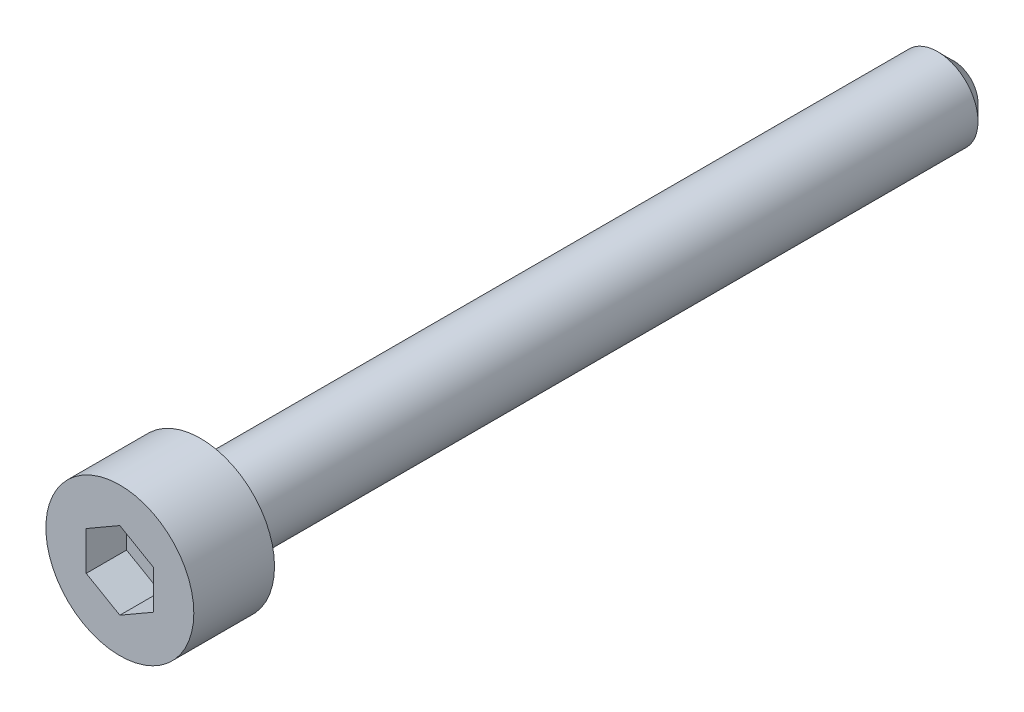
ISO-10303-21;
HEADER;
FILE_DESCRIPTION(('STEP AP214'),'2;1');
FILE_NAME('part.step','',(''),(''),'','','');
FILE_SCHEMA(('AUTOMOTIVE_DESIGN { 1 0 10303 214 1 1 1 1 }'));
ENDSEC;
DATA;
#1=APPLICATION_CONTEXT('core data for automotive mechanical design processes');
#2=APPLICATION_PROTOCOL_DEFINITION('international standard','automotive_design',2000,#1);
#3=PRODUCT_CONTEXT('',#1,'mechanical');
#4=PRODUCT('Part','Part','',(#3));
#5=PRODUCT_RELATED_PRODUCT_CATEGORY('part','',(#4));
#6=PRODUCT_DEFINITION_FORMATION('','',#4);
#7=PRODUCT_DEFINITION_CONTEXT('part definition',#1,'design');
#8=PRODUCT_DEFINITION('design','',#6,#7);
#9=PRODUCT_DEFINITION_SHAPE('','',#8);
#10=(LENGTH_UNIT() NAMED_UNIT(*) SI_UNIT(.MILLI.,.METRE.));
#11=(NAMED_UNIT(*) PLANE_ANGLE_UNIT() SI_UNIT($,.RADIAN.));
#12=(NAMED_UNIT(*) SI_UNIT($,.STERADIAN.) SOLID_ANGLE_UNIT());
#13=UNCERTAINTY_MEASURE_WITH_UNIT(LENGTH_MEASURE(1.E-05),#10,'distance_accuracy_value','');
#14=(GEOMETRIC_REPRESENTATION_CONTEXT(3) GLOBAL_UNCERTAINTY_ASSIGNED_CONTEXT((#13)) GLOBAL_UNIT_ASSIGNED_CONTEXT((#10,
#11,#12)) REPRESENTATION_CONTEXT('',''));
#15=CARTESIAN_POINT('',(0.,0.,0.));
#16=DIRECTION('',(0.,0.,1.));
#17=DIRECTION('',(1.,0.,0.));
#18=AXIS2_PLACEMENT_3D('',#15,#16,#17);
#19=CARTESIAN_POINT('',(0.,1.44337567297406,1.5));
#20=DIRECTION('',(-0.5,-0.86602540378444,0.));
#21=DIRECTION('',(0.86602540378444,-0.5,0.));
#22=AXIS2_PLACEMENT_3D('',#19,#20,#21);
#23=PLANE('',#22);
#24=DIRECTION('',(0.,0.,1.));
#25=VECTOR('',#24,1.);
#26=CARTESIAN_POINT('',(1.25,0.721687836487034,1.5));
#27=LINE('',#26,#25);
#28=CARTESIAN_POINT('',(1.25,0.721687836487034,1.5));
#29=VERTEX_POINT('',#28);
#30=CARTESIAN_POINT('',(1.25,0.721687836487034,3.));
#31=VERTEX_POINT('',#30);
#32=EDGE_CURVE('E63',#29,#31,#27,.T.);
#33=ORIENTED_EDGE('',*,*,#32,.T.);
#34=DIRECTION('',(0.866025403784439,-0.5,0.));
#35=VECTOR('',#34,1.);
#36=CARTESIAN_POINT('',(0.,1.44337567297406,3.));
#37=LINE('',#36,#35);
#38=CARTESIAN_POINT('',(0.,1.44337567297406,3.));
#39=VERTEX_POINT('',#38);
#40=EDGE_CURVE('E29',#39,#31,#37,.T.);
#41=ORIENTED_EDGE('',*,*,#40,.F.);
#42=DIRECTION('',(0.,0.,1.));
#43=VECTOR('',#42,1.);
#44=CARTESIAN_POINT('',(0.,1.44337567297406,1.5));
#45=LINE('',#44,#43);
#46=CARTESIAN_POINT('',(0.,1.44337567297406,1.5));
#47=VERTEX_POINT('',#46);
#48=EDGE_CURVE('E33',#47,#39,#45,.T.);
#49=ORIENTED_EDGE('',*,*,#48,.F.);
#50=DIRECTION('',(0.866025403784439,-0.5,0.));
#51=VECTOR('',#50,1.);
#52=CARTESIAN_POINT('',(0.,1.44337567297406,1.5));
#53=LINE('',#52,#51);
#54=EDGE_CURVE('E65',#47,#29,#53,.T.);
#55=ORIENTED_EDGE('',*,*,#54,.T.);
#56=EDGE_LOOP('',(#33,#41,#49,#55));
#57=FACE_BOUND('',#56,.T.);
#58=ADVANCED_FACE('F14',(#57),#23,.T.);
#59=CARTESIAN_POINT('',(1.25,-0.721687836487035,1.5));
#60=DIRECTION('',(1.,0.,0.));
#61=DIRECTION('',(0.,1.,0.));
#62=AXIS2_PLACEMENT_3D('',#59,#60,#61);
#63=PLANE('',#62);
#64=DIRECTION('',(0.,0.,1.));
#65=VECTOR('',#64,1.);
#66=CARTESIAN_POINT('',(1.25,-0.721687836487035,1.5));
#67=LINE('',#66,#65);
#68=CARTESIAN_POINT('',(1.25,-0.721687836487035,1.5));
#69=VERTEX_POINT('',#68);
#70=CARTESIAN_POINT('',(1.25,-0.721687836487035,3.));
#71=VERTEX_POINT('',#70);
#72=EDGE_CURVE('E70',#69,#71,#67,.T.);
#73=ORIENTED_EDGE('',*,*,#72,.T.);
#74=DIRECTION('',(0.,1.,0.));
#75=VECTOR('',#74,1.);
#76=CARTESIAN_POINT('',(1.25,-0.721687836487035,3.));
#77=LINE('',#76,#75);
#78=EDGE_CURVE('E73',#71,#31,#77,.T.);
#79=ORIENTED_EDGE('',*,*,#78,.T.);
#80=ORIENTED_EDGE('',*,*,#32,.F.);
#81=DIRECTION('',(0.,1.,0.));
#82=VECTOR('',#81,1.);
#83=CARTESIAN_POINT('',(1.25,-0.721687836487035,1.5));
#84=LINE('',#83,#82);
#85=EDGE_CURVE('E100',#69,#29,#84,.T.);
#86=ORIENTED_EDGE('',*,*,#85,.F.);
#87=EDGE_LOOP('',(#73,#79,#80,#86));
#88=FACE_BOUND('',#87,.T.);
#89=ADVANCED_FACE('F74',(#88),#63,.F.);
#90=CARTESIAN_POINT('',(0.,-1.44337567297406,1.5));
#91=DIRECTION('',(0.5,-0.86602540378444,0.));
#92=DIRECTION('',(0.86602540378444,0.5,0.));
#93=AXIS2_PLACEMENT_3D('',#90,#91,#92);
#94=PLANE('',#93);
#95=DIRECTION('',(0.,0.,1.));
#96=VECTOR('',#95,1.);
#97=CARTESIAN_POINT('',(0.,-1.44337567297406,1.5));
#98=LINE('',#97,#96);
#99=CARTESIAN_POINT('',(0.,-1.44337567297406,1.5));
#100=VERTEX_POINT('',#99);
#101=CARTESIAN_POINT('',(0.,-1.44337567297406,3.));
#102=VERTEX_POINT('',#101);
#103=EDGE_CURVE('E108',#100,#102,#98,.T.);
#104=ORIENTED_EDGE('',*,*,#103,.T.);
#105=DIRECTION('',(0.86602540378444,0.5,0.));
#106=VECTOR('',#105,1.);
#107=CARTESIAN_POINT('',(0.,-1.44337567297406,3.));
#108=LINE('',#107,#106);
#109=EDGE_CURVE('E78',#102,#71,#108,.T.);
#110=ORIENTED_EDGE('',*,*,#109,.T.);
#111=ORIENTED_EDGE('',*,*,#72,.F.);
#112=DIRECTION('',(0.86602540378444,0.5,0.));
#113=VECTOR('',#112,1.);
#114=CARTESIAN_POINT('',(0.,-1.44337567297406,1.5));
#115=LINE('',#114,#113);
#116=EDGE_CURVE('E97',#100,#69,#115,.T.);
#117=ORIENTED_EDGE('',*,*,#116,.F.);
#118=EDGE_LOOP('',(#104,#110,#111,#117));
#119=FACE_BOUND('',#118,.T.);
#120=ADVANCED_FACE('F139',(#119),#94,.F.);
#121=CARTESIAN_POINT('',(0.,-1.44337567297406,1.5));
#122=DIRECTION('',(0.5,0.86602540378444,0.));
#123=DIRECTION('',(-0.86602540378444,0.5,0.));
#124=AXIS2_PLACEMENT_3D('',#121,#122,#123);
#125=PLANE('',#124);
#126=DIRECTION('',(0.,0.,1.));
#127=VECTOR('',#126,1.);
#128=CARTESIAN_POINT('',(-1.25,-0.721687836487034,1.5));
#129=LINE('',#128,#127);
#130=CARTESIAN_POINT('',(-1.25,-0.721687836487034,1.5));
#131=VERTEX_POINT('',#130);
#132=CARTESIAN_POINT('',(-1.25,-0.721687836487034,3.));
#133=VERTEX_POINT('',#132);
#134=EDGE_CURVE('E106',#131,#133,#129,.T.);
#135=ORIENTED_EDGE('',*,*,#134,.T.);
#136=DIRECTION('',(-0.86602540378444,0.5,0.));
#137=VECTOR('',#136,1.);
#138=CARTESIAN_POINT('',(0.,-1.44337567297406,3.));
#139=LINE('',#138,#137);
#140=EDGE_CURVE('E188',#102,#133,#139,.T.);
#141=ORIENTED_EDGE('',*,*,#140,.F.);
#142=ORIENTED_EDGE('',*,*,#103,.F.);
#143=DIRECTION('',(-0.86602540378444,0.5,0.));
#144=VECTOR('',#143,1.);
#145=CARTESIAN_POINT('',(0.,-1.44337567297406,1.5));
#146=LINE('',#145,#144);
#147=EDGE_CURVE('E94',#100,#131,#146,.T.);
#148=ORIENTED_EDGE('',*,*,#147,.T.);
#149=EDGE_LOOP('',(#135,#141,#142,#148));
#150=FACE_BOUND('',#149,.T.);
#151=ADVANCED_FACE('F151',(#150),#125,.T.);
#152=CARTESIAN_POINT('',(-1.25,0.721687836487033,1.5));
#153=DIRECTION('',(-1.,0.,0.));
#154=DIRECTION('',(0.,-1.,0.));
#155=AXIS2_PLACEMENT_3D('',#152,#153,#154);
#156=PLANE('',#155);
#157=DIRECTION('',(0.,0.,1.));
#158=VECTOR('',#157,1.);
#159=CARTESIAN_POINT('',(-1.25,0.721687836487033,1.5));
#160=LINE('',#159,#158);
#161=CARTESIAN_POINT('',(-1.25,0.721687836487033,1.5));
#162=VERTEX_POINT('',#161);
#163=CARTESIAN_POINT('',(-1.25,0.721687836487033,3.));
#164=VERTEX_POINT('',#163);
#165=EDGE_CURVE('E104',#162,#164,#160,.T.);
#166=ORIENTED_EDGE('',*,*,#165,.T.);
#167=DIRECTION('',(0.,-1.,0.));
#168=VECTOR('',#167,1.);
#169=CARTESIAN_POINT('',(-1.25,0.721687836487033,3.));
#170=LINE('',#169,#168);
#171=EDGE_CURVE('E189',#164,#133,#170,.T.);
#172=ORIENTED_EDGE('',*,*,#171,.T.);
#173=ORIENTED_EDGE('',*,*,#134,.F.);
#174=DIRECTION('',(0.,-1.,0.));
#175=VECTOR('',#174,1.);
#176=CARTESIAN_POINT('',(-1.25,0.721687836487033,1.5));
#177=LINE('',#176,#175);
#178=EDGE_CURVE('E91',#162,#131,#177,.T.);
#179=ORIENTED_EDGE('',*,*,#178,.F.);
#180=EDGE_LOOP('',(#166,#172,#173,#179));
#181=FACE_BOUND('',#180,.T.);
#182=ADVANCED_FACE('F147',(#181),#156,.F.);
#183=CARTESIAN_POINT('',(0.,1.44337567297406,1.5));
#184=DIRECTION('',(-0.5,0.86602540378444,0.));
#185=DIRECTION('',(-0.86602540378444,-0.5,0.));
#186=AXIS2_PLACEMENT_3D('',#183,#184,#185);
#187=PLANE('',#186);
#188=DIRECTION('',(-0.86602540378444,-0.5,0.));
#189=VECTOR('',#188,1.);
#190=CARTESIAN_POINT('',(0.,1.44337567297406,1.5));
#191=LINE('',#190,#189);
#192=EDGE_CURVE('E88',#47,#162,#191,.T.);
#193=ORIENTED_EDGE('',*,*,#192,.F.);
#194=ORIENTED_EDGE('',*,*,#48,.T.);
#195=DIRECTION('',(-0.86602540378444,-0.5,0.));
#196=VECTOR('',#195,1.);
#197=CARTESIAN_POINT('',(0.,1.44337567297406,3.));
#198=LINE('',#197,#196);
#199=EDGE_CURVE('E84',#39,#164,#198,.T.);
#200=ORIENTED_EDGE('',*,*,#199,.T.);
#201=ORIENTED_EDGE('',*,*,#165,.F.);
#202=EDGE_LOOP('',(#193,#194,#200,#201));
#203=FACE_BOUND('',#202,.T.);
#204=ADVANCED_FACE('F144',(#203),#187,.F.);
#205=CARTESIAN_POINT('',(1.25,0.721687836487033,1.5));
#206=DIRECTION('',(0.,0.,1.));
#207=DIRECTION('',(1.,0.,0.));
#208=AXIS2_PLACEMENT_3D('',#205,#206,#207);
#209=PLANE('',#208);
#210=ORIENTED_EDGE('',*,*,#54,.F.);
#211=ORIENTED_EDGE('',*,*,#192,.T.);
#212=ORIENTED_EDGE('',*,*,#178,.T.);
#213=ORIENTED_EDGE('',*,*,#147,.F.);
#214=ORIENTED_EDGE('',*,*,#116,.T.);
#215=ORIENTED_EDGE('',*,*,#85,.T.);
#216=EDGE_LOOP('',(#210,#211,#212,#213,#214,#215));
#217=FACE_BOUND('',#216,.T.);
#218=ADVANCED_FACE('F143',(#217),#209,.T.);
#219=CARTESIAN_POINT('',(0.,0.,3.));
#220=DIRECTION('',(0.,0.,1.));
#221=DIRECTION('',(1.,0.,0.));
#222=AXIS2_PLACEMENT_3D('',#219,#220,#221);
#223=PLANE('',#222);
#224=CARTESIAN_POINT('',(0.,0.,3.));
#225=DIRECTION('',(0.,0.,1.));
#226=DIRECTION('',(1.,0.,0.));
#227=AXIS2_PLACEMENT_3D('',#224,#225,#226);
#228=CIRCLE('',#227,2.75);
#229=CARTESIAN_POINT('',(2.75,0.,3.));
#230=VERTEX_POINT('',#229);
#231=EDGE_CURVE('E116',#230,#230,#228,.T.);
#232=ORIENTED_EDGE('',*,*,#231,.T.);
#233=EDGE_LOOP('',(#232));
#234=FACE_BOUND('',#233,.T.);
#235=ORIENTED_EDGE('',*,*,#199,.F.);
#236=ORIENTED_EDGE('',*,*,#40,.T.);
#237=ORIENTED_EDGE('',*,*,#78,.F.);
#238=ORIENTED_EDGE('',*,*,#109,.F.);
#239=ORIENTED_EDGE('',*,*,#140,.T.);
#240=ORIENTED_EDGE('',*,*,#171,.F.);
#241=EDGE_LOOP('',(#235,#236,#237,#238,#239,#240));
#242=FACE_BOUND('',#241,.T.);
#243=ADVANCED_FACE('F81',(#234,#242),#223,.T.);
#244=CARTESIAN_POINT('',(0.,0.,-5.));
#245=DIRECTION('',(0.,0.,1.));
#246=DIRECTION('',(1.,0.,0.));
#247=AXIS2_PLACEMENT_3D('',#244,#245,#246);
#248=CYLINDRICAL_SURFACE('',#247,2.75);
#249=CARTESIAN_POINT('',(0.,0.,0.));
#250=DIRECTION('',(0.,0.,1.));
#251=DIRECTION('',(1.,0.,0.));
#252=AXIS2_PLACEMENT_3D('',#249,#250,#251);
#253=CIRCLE('',#252,2.75);
#254=CARTESIAN_POINT('',(2.75,0.,0.));
#255=VERTEX_POINT('',#254);
#256=EDGE_CURVE('E113',#255,#255,#253,.T.);
#257=ORIENTED_EDGE('',*,*,#256,.T.);
#258=EDGE_LOOP('',(#257));
#259=FACE_BOUND('',#258,.T.);
#260=ORIENTED_EDGE('',*,*,#231,.F.);
#261=EDGE_LOOP('',(#260));
#262=FACE_BOUND('',#261,.T.);
#263=ADVANCED_FACE('F165',(#259,#262),#248,.T.);
#264=CARTESIAN_POINT('',(2.75,0.,0.));
#265=DIRECTION('',(0.,0.,-1.));
#266=DIRECTION('',(-1.,0.,0.));
#267=AXIS2_PLACEMENT_3D('',#264,#265,#266);
#268=PLANE('',#267);
#269=CARTESIAN_POINT('',(0.,0.,0.));
#270=DIRECTION('',(0.,0.,1.));
#271=DIRECTION('',(1.,0.,0.));
#272=AXIS2_PLACEMENT_3D('',#269,#270,#271);
#273=CIRCLE('',#272,1.5);
#274=CARTESIAN_POINT('',(1.5,0.,0.));
#275=VERTEX_POINT('',#274);
#276=EDGE_CURVE('E69',#275,#275,#273,.T.);
#277=ORIENTED_EDGE('',*,*,#276,.T.);
#278=EDGE_LOOP('',(#277));
#279=FACE_BOUND('',#278,.T.);
#280=ORIENTED_EDGE('',*,*,#256,.F.);
#281=EDGE_LOOP('',(#280));
#282=FACE_BOUND('',#281,.T.);
#283=ADVANCED_FACE('F161',(#279,#282),#268,.T.);
#284=CARTESIAN_POINT('',(0.,0.,-5.));
#285=DIRECTION('',(0.,0.,1.));
#286=DIRECTION('',(1.,0.,0.));
#287=AXIS2_PLACEMENT_3D('',#284,#285,#286);
#288=CYLINDRICAL_SURFACE('',#287,1.5);
#289=CARTESIAN_POINT('',(0.,0.,-27.4));
#290=DIRECTION('',(0.,0.,-1.));
#291=DIRECTION('',(-1.,0.,0.));
#292=AXIS2_PLACEMENT_3D('',#289,#290,#291);
#293=CIRCLE('',#292,1.5);
#294=CARTESIAN_POINT('',(-1.5,0.,-27.4));
#295=VERTEX_POINT('',#294);
#296=EDGE_CURVE('E9',#295,#295,#293,.F.);
#297=ORIENTED_EDGE('',*,*,#296,.T.);
#298=EDGE_LOOP('',(#297));
#299=FACE_BOUND('',#298,.T.);
#300=ORIENTED_EDGE('',*,*,#276,.F.);
#301=EDGE_LOOP('',(#300));
#302=FACE_BOUND('',#301,.T.);
#303=ADVANCED_FACE('F130',(#299,#302),#288,.T.);
#304=CARTESIAN_POINT('',(0.,0.,-28.));
#305=DIRECTION('',(0.,0.,-1.));
#306=DIRECTION('',(-1.,0.,0.));
#307=AXIS2_PLACEMENT_3D('',#304,#305,#306);
#308=PLANE('',#307);
#309=CARTESIAN_POINT('',(0.,0.,-28.));
#310=DIRECTION('',(0.,0.,-1.));
#311=DIRECTION('',(-1.,0.,0.));
#312=AXIS2_PLACEMENT_3D('',#309,#310,#311);
#313=CIRCLE('',#312,0.9);
#314=CARTESIAN_POINT('',(-0.9,0.,-28.));
#315=VERTEX_POINT('',#314);
#316=EDGE_CURVE('E22',#315,#315,#313,.T.);
#317=ORIENTED_EDGE('',*,*,#316,.T.);
#318=EDGE_LOOP('',(#317));
#319=FACE_BOUND('',#318,.T.);
#320=ADVANCED_FACE('F121',(#319),#308,.T.);
#321=CARTESIAN_POINT('',(0.,0.,-28.));
#322=DIRECTION('',(0.,0.,1.));
#323=DIRECTION('',(1.,0.,0.));
#324=AXIS2_PLACEMENT_3D('',#321,#322,#323);
#325=CONICAL_SURFACE('',#324,0.9,0.785398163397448);
#326=ORIENTED_EDGE('',*,*,#296,.F.);
#327=EDGE_LOOP('',(#326));
#328=FACE_BOUND('',#327,.T.);
#329=ORIENTED_EDGE('',*,*,#316,.F.);
#330=EDGE_LOOP('',(#329));
#331=FACE_BOUND('',#330,.T.);
#332=ADVANCED_FACE('F16',(#328,#331),#325,.T.);
#333=CLOSED_SHELL('',(#58,#89,#120,#151,#182,#204,#218,#243,#263,#283,#303,#320,#332));
#334=MANIFOLD_SOLID_BREP('B1',#333);
#335=ADVANCED_BREP_SHAPE_REPRESENTATION('',(#18,#334),#14);
#336=SHAPE_DEFINITION_REPRESENTATION(#9,#335);
ENDSEC;
END-ISO-10303-21;
